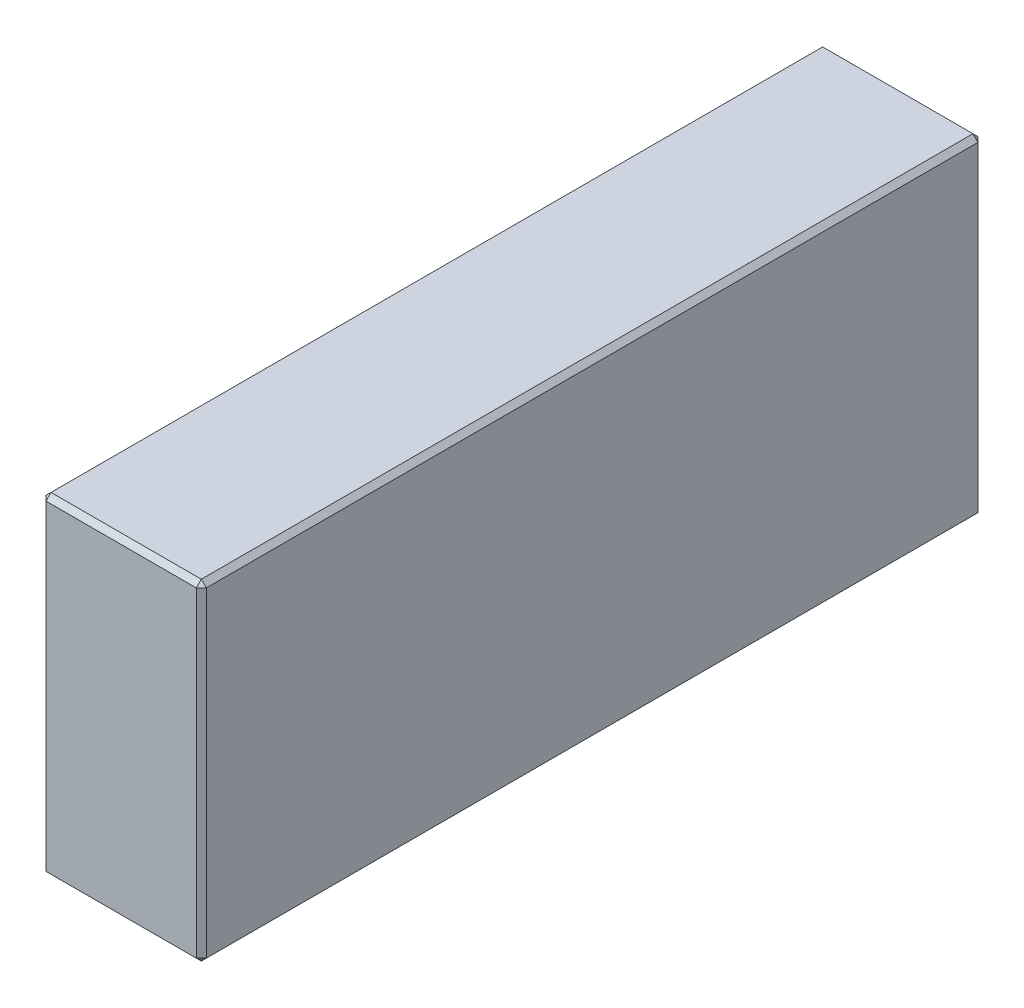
ISO-10303-21;
HEADER;
FILE_DESCRIPTION(('STEP AP214'),'2;1');
FILE_NAME('part.step','',(''),(''),'','','');
FILE_SCHEMA(('AUTOMOTIVE_DESIGN { 1 0 10303 214 1 1 1 1 }'));
ENDSEC;
DATA;
#1=APPLICATION_CONTEXT('core data for automotive mechanical design processes');
#2=APPLICATION_PROTOCOL_DEFINITION('international standard','automotive_design',2000,#1);
#3=PRODUCT_CONTEXT('',#1,'mechanical');
#4=PRODUCT('Part','Part','',(#3));
#5=PRODUCT_RELATED_PRODUCT_CATEGORY('part','',(#4));
#6=PRODUCT_DEFINITION_FORMATION('','',#4);
#7=PRODUCT_DEFINITION_CONTEXT('part definition',#1,'design');
#8=PRODUCT_DEFINITION('design','',#6,#7);
#9=PRODUCT_DEFINITION_SHAPE('','',#8);
#10=(LENGTH_UNIT() NAMED_UNIT(*) SI_UNIT(.MILLI.,.METRE.));
#11=(NAMED_UNIT(*) PLANE_ANGLE_UNIT() SI_UNIT($,.RADIAN.));
#12=(NAMED_UNIT(*) SI_UNIT($,.STERADIAN.) SOLID_ANGLE_UNIT());
#13=UNCERTAINTY_MEASURE_WITH_UNIT(LENGTH_MEASURE(1.E-05),#10,'distance_accuracy_value','');
#14=(GEOMETRIC_REPRESENTATION_CONTEXT(3) GLOBAL_UNCERTAINTY_ASSIGNED_CONTEXT((#13)) GLOBAL_UNIT_ASSIGNED_CONTEXT((#10,
#11,#12)) REPRESENTATION_CONTEXT('',''));
#15=CARTESIAN_POINT('',(0.,0.,0.));
#16=DIRECTION('',(0.,0.,1.));
#17=DIRECTION('',(1.,0.,0.));
#18=AXIS2_PLACEMENT_3D('',#15,#16,#17);
#19=CARTESIAN_POINT('',(-16.,66.,78.));
#20=DIRECTION('',(1.,0.,0.));
#21=DIRECTION('',(0.,0.,-1.));
#22=AXIS2_PLACEMENT_3D('',#19,#20,#21);
#23=PLANE('',#22);
#24=DIRECTION('',(0.,-1.,0.));
#25=VECTOR('',#24,1.);
#26=CARTESIAN_POINT('',(-16.,66.,-77.));
#27=LINE('',#26,#25);
#28=CARTESIAN_POINT('',(-16.,65.,-77.));
#29=VERTEX_POINT('',#28);
#30=CARTESIAN_POINT('',(-16.,1.00000000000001,-77.));
#31=VERTEX_POINT('',#30);
#32=EDGE_CURVE('E114',#29,#31,#27,.T.);
#33=ORIENTED_EDGE('',*,*,#32,.T.);
#34=DIRECTION('',(0.,0.,1.));
#35=VECTOR('',#34,1.);
#36=CARTESIAN_POINT('',(-16.,1.00000000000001,78.));
#37=LINE('',#36,#35);
#38=CARTESIAN_POINT('',(-16.,1.00000000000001,77.));
#39=VERTEX_POINT('',#38);
#40=EDGE_CURVE('E110',#31,#39,#37,.T.);
#41=ORIENTED_EDGE('',*,*,#40,.T.);
#42=DIRECTION('',(0.,1.,0.));
#43=VECTOR('',#42,1.);
#44=CARTESIAN_POINT('',(-16.,66.,77.));
#45=LINE('',#44,#43);
#46=CARTESIAN_POINT('',(-16.,65.,77.));
#47=VERTEX_POINT('',#46);
#48=EDGE_CURVE('E103',#39,#47,#45,.T.);
#49=ORIENTED_EDGE('',*,*,#48,.T.);
#50=DIRECTION('',(0.,0.,-1.));
#51=VECTOR('',#50,1.);
#52=CARTESIAN_POINT('',(-16.,65.,-78.));
#53=LINE('',#52,#51);
#54=EDGE_CURVE('E107',#47,#29,#53,.T.);
#55=ORIENTED_EDGE('',*,*,#54,.T.);
#56=EDGE_LOOP('',(#33,#41,#49,#55));
#57=FACE_BOUND('',#56,.T.);
#58=ADVANCED_FACE('F15',(#57),#23,.F.);
#59=CARTESIAN_POINT('',(16.,66.,78.));
#60=DIRECTION('',(0.,0.,-1.));
#61=DIRECTION('',(-1.,0.,0.));
#62=AXIS2_PLACEMENT_3D('',#59,#60,#61);
#63=PLANE('',#62);
#64=DIRECTION('',(-1.,0.,0.));
#65=VECTOR('',#64,1.);
#66=CARTESIAN_POINT('',(-16.,65.,78.));
#67=LINE('',#66,#65);
#68=CARTESIAN_POINT('',(15.,65.,78.));
#69=VERTEX_POINT('',#68);
#70=CARTESIAN_POINT('',(-15.,65.,78.));
#71=VERTEX_POINT('',#70);
#72=EDGE_CURVE('E164',#69,#71,#67,.T.);
#73=ORIENTED_EDGE('',*,*,#72,.T.);
#74=DIRECTION('',(0.,-1.,0.));
#75=VECTOR('',#74,1.);
#76=CARTESIAN_POINT('',(-15.,66.,78.));
#77=LINE('',#76,#75);
#78=CARTESIAN_POINT('',(-15.,1.00000000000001,78.));
#79=VERTEX_POINT('',#78);
#80=EDGE_CURVE('E122',#71,#79,#77,.T.);
#81=ORIENTED_EDGE('',*,*,#80,.T.);
#82=DIRECTION('',(1.,0.,0.));
#83=VECTOR('',#82,1.);
#84=CARTESIAN_POINT('',(16.,1.00000000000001,78.));
#85=LINE('',#84,#83);
#86=CARTESIAN_POINT('',(15.,1.00000000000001,78.));
#87=VERTEX_POINT('',#86);
#88=EDGE_CURVE('E168',#79,#87,#85,.T.);
#89=ORIENTED_EDGE('',*,*,#88,.T.);
#90=DIRECTION('',(0.,1.,0.));
#91=VECTOR('',#90,1.);
#92=CARTESIAN_POINT('',(15.,66.,78.));
#93=LINE('',#92,#91);
#94=EDGE_CURVE('E166',#87,#69,#93,.T.);
#95=ORIENTED_EDGE('',*,*,#94,.T.);
#96=EDGE_LOOP('',(#73,#81,#89,#95));
#97=FACE_BOUND('',#96,.T.);
#98=ADVANCED_FACE('F275',(#97),#63,.F.);
#99=CARTESIAN_POINT('',(16.,66.,78.));
#100=DIRECTION('',(-1.,0.,0.));
#101=DIRECTION('',(0.,0.,1.));
#102=AXIS2_PLACEMENT_3D('',#99,#100,#101);
#103=PLANE('',#102);
#104=DIRECTION('',(0.,0.,-1.));
#105=VECTOR('',#104,1.);
#106=CARTESIAN_POINT('',(16.,1.00000000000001,78.));
#107=LINE('',#106,#105);
#108=CARTESIAN_POINT('',(16.,1.00000000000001,77.));
#109=VERTEX_POINT('',#108);
#110=CARTESIAN_POINT('',(16.,1.00000000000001,-77.));
#111=VERTEX_POINT('',#110);
#112=EDGE_CURVE('E159',#109,#111,#107,.T.);
#113=ORIENTED_EDGE('',*,*,#112,.T.);
#114=DIRECTION('',(0.,1.,0.));
#115=VECTOR('',#114,1.);
#116=CARTESIAN_POINT('',(16.,66.,-77.));
#117=LINE('',#116,#115);
#118=CARTESIAN_POINT('',(16.,65.,-77.));
#119=VERTEX_POINT('',#118);
#120=EDGE_CURVE('E161',#111,#119,#117,.T.);
#121=ORIENTED_EDGE('',*,*,#120,.T.);
#122=DIRECTION('',(0.,0.,1.));
#123=VECTOR('',#122,1.);
#124=CARTESIAN_POINT('',(16.,65.,78.));
#125=LINE('',#124,#123);
#126=CARTESIAN_POINT('',(16.,65.,77.));
#127=VERTEX_POINT('',#126);
#128=EDGE_CURVE('E155',#119,#127,#125,.T.);
#129=ORIENTED_EDGE('',*,*,#128,.T.);
#130=DIRECTION('',(0.,-1.,0.));
#131=VECTOR('',#130,1.);
#132=CARTESIAN_POINT('',(16.,66.,77.));
#133=LINE('',#132,#131);
#134=EDGE_CURVE('E157',#127,#109,#133,.T.);
#135=ORIENTED_EDGE('',*,*,#134,.T.);
#136=EDGE_LOOP('',(#113,#121,#129,#135));
#137=FACE_BOUND('',#136,.T.);
#138=ADVANCED_FACE('F254',(#137),#103,.F.);
#139=CARTESIAN_POINT('',(16.,66.,-78.));
#140=DIRECTION('',(0.,0.,1.));
#141=DIRECTION('',(1.,0.,0.));
#142=AXIS2_PLACEMENT_3D('',#139,#140,#141);
#143=PLANE('',#142);
#144=DIRECTION('',(0.,-1.,0.));
#145=VECTOR('',#144,1.);
#146=CARTESIAN_POINT('',(15.,66.,-78.));
#147=LINE('',#146,#145);
#148=CARTESIAN_POINT('',(15.,65.,-78.));
#149=VERTEX_POINT('',#148);
#150=CARTESIAN_POINT('',(15.,1.00000000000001,-78.));
#151=VERTEX_POINT('',#150);
#152=EDGE_CURVE('E148',#149,#151,#147,.T.);
#153=ORIENTED_EDGE('',*,*,#152,.T.);
#154=DIRECTION('',(-1.,0.,0.));
#155=VECTOR('',#154,1.);
#156=CARTESIAN_POINT('',(16.,1.00000000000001,-78.));
#157=LINE('',#156,#155);
#158=CARTESIAN_POINT('',(-15.,1.00000000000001,-78.));
#159=VERTEX_POINT('',#158);
#160=EDGE_CURVE('E153',#151,#159,#157,.T.);
#161=ORIENTED_EDGE('',*,*,#160,.T.);
#162=DIRECTION('',(0.,1.,0.));
#163=VECTOR('',#162,1.);
#164=CARTESIAN_POINT('',(-15.,66.,-78.));
#165=LINE('',#164,#163);
#166=CARTESIAN_POINT('',(-15.,65.,-78.));
#167=VERTEX_POINT('',#166);
#168=EDGE_CURVE('E150',#159,#167,#165,.T.);
#169=ORIENTED_EDGE('',*,*,#168,.T.);
#170=DIRECTION('',(1.,0.,0.));
#171=VECTOR('',#170,1.);
#172=CARTESIAN_POINT('',(16.,65.,-78.));
#173=LINE('',#172,#171);
#174=EDGE_CURVE('E146',#167,#149,#173,.T.);
#175=ORIENTED_EDGE('',*,*,#174,.T.);
#176=EDGE_LOOP('',(#153,#161,#169,#175));
#177=FACE_BOUND('',#176,.T.);
#178=ADVANCED_FACE('F284',(#177),#143,.F.);
#179=CARTESIAN_POINT('',(0.,66.,0.));
#180=DIRECTION('',(0.,1.,0.));
#181=DIRECTION('',(0.,0.,1.));
#182=AXIS2_PLACEMENT_3D('',#179,#180,#181);
#183=PLANE('',#182);
#184=DIRECTION('',(0.,0.,-1.));
#185=VECTOR('',#184,1.);
#186=CARTESIAN_POINT('',(15.,66.,-78.));
#187=LINE('',#186,#185);
#188=CARTESIAN_POINT('',(15.,66.,77.));
#189=VERTEX_POINT('',#188);
#190=CARTESIAN_POINT('',(15.,66.,-77.));
#191=VERTEX_POINT('',#190);
#192=EDGE_CURVE('E24',#189,#191,#187,.T.);
#193=ORIENTED_EDGE('',*,*,#192,.T.);
#194=DIRECTION('',(-1.,0.,0.));
#195=VECTOR('',#194,1.);
#196=CARTESIAN_POINT('',(-16.,66.,-77.));
#197=LINE('',#196,#195);
#198=CARTESIAN_POINT('',(-15.,66.,-77.));
#199=VERTEX_POINT('',#198);
#200=EDGE_CURVE('E9',#191,#199,#197,.T.);
#201=ORIENTED_EDGE('',*,*,#200,.T.);
#202=DIRECTION('',(0.,0.,1.));
#203=VECTOR('',#202,1.);
#204=CARTESIAN_POINT('',(-15.,66.,78.));
#205=LINE('',#204,#203);
#206=CARTESIAN_POINT('',(-15.,66.,77.));
#207=VERTEX_POINT('',#206);
#208=EDGE_CURVE('E180',#199,#207,#205,.T.);
#209=ORIENTED_EDGE('',*,*,#208,.T.);
#210=DIRECTION('',(1.,0.,0.));
#211=VECTOR('',#210,1.);
#212=CARTESIAN_POINT('',(16.,66.,77.));
#213=LINE('',#212,#211);
#214=EDGE_CURVE('E35',#207,#189,#213,.T.);
#215=ORIENTED_EDGE('',*,*,#214,.T.);
#216=EDGE_LOOP('',(#193,#201,#209,#215));
#217=FACE_BOUND('',#216,.T.);
#218=ADVANCED_FACE('F350',(#217),#183,.T.);
#219=CARTESIAN_POINT('',(0.,0.,0.));
#220=DIRECTION('',(0.,1.,0.));
#221=DIRECTION('',(0.,0.,1.));
#222=AXIS2_PLACEMENT_3D('',#219,#220,#221);
#223=PLANE('',#222);
#224=DIRECTION('',(0.,0.,1.));
#225=VECTOR('',#224,1.);
#226=CARTESIAN_POINT('',(15.,0.,0.));
#227=LINE('',#226,#225);
#228=CARTESIAN_POINT('',(15.,0.,-77.));
#229=VERTEX_POINT('',#228);
#230=CARTESIAN_POINT('',(15.,0.,77.));
#231=VERTEX_POINT('',#230);
#232=EDGE_CURVE('E171',#229,#231,#227,.T.);
#233=ORIENTED_EDGE('',*,*,#232,.T.);
#234=DIRECTION('',(-1.,0.,0.));
#235=VECTOR('',#234,1.);
#236=CARTESIAN_POINT('',(0.,0.,77.));
#237=LINE('',#236,#235);
#238=CARTESIAN_POINT('',(-15.,0.,77.));
#239=VERTEX_POINT('',#238);
#240=EDGE_CURVE('E177',#231,#239,#237,.T.);
#241=ORIENTED_EDGE('',*,*,#240,.T.);
#242=DIRECTION('',(0.,0.,-1.));
#243=VECTOR('',#242,1.);
#244=CARTESIAN_POINT('',(-15.,0.,0.));
#245=LINE('',#244,#243);
#246=CARTESIAN_POINT('',(-15.,0.,-77.));
#247=VERTEX_POINT('',#246);
#248=EDGE_CURVE('E175',#239,#247,#245,.T.);
#249=ORIENTED_EDGE('',*,*,#248,.T.);
#250=DIRECTION('',(1.,0.,0.));
#251=VECTOR('',#250,1.);
#252=CARTESIAN_POINT('',(0.,0.,-77.));
#253=LINE('',#252,#251);
#254=EDGE_CURVE('E173',#247,#229,#253,.T.);
#255=ORIENTED_EDGE('',*,*,#254,.T.);
#256=EDGE_LOOP('',(#233,#241,#249,#255));
#257=FACE_BOUND('',#256,.T.);
#258=ADVANCED_FACE('F246',(#257),#223,.F.);
#259=CARTESIAN_POINT('',(16.,66.,77.));
#260=DIRECTION('',(-0.707106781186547,0.,-0.707106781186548));
#261=DIRECTION('',(0.,-1.,0.));
#262=AXIS2_PLACEMENT_3D('',#259,#260,#261);
#263=PLANE('',#262);
#264=DIRECTION('',(-0.707106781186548,0.,0.707106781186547));
#265=VECTOR('',#264,1.);
#266=CARTESIAN_POINT('',(15.,65.,78.));
#267=LINE('',#266,#265);
#268=EDGE_CURVE('E19',#69,#127,#267,.F.);
#269=ORIENTED_EDGE('',*,*,#268,.F.);
#270=ORIENTED_EDGE('',*,*,#94,.F.);
#271=DIRECTION('',(0.707106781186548,0.,-0.707106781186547));
#272=VECTOR('',#271,1.);
#273=CARTESIAN_POINT('',(15.,1.00000000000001,78.));
#274=LINE('',#273,#272);
#275=EDGE_CURVE('E142',#109,#87,#274,.F.);
#276=ORIENTED_EDGE('',*,*,#275,.F.);
#277=ORIENTED_EDGE('',*,*,#134,.F.);
#278=EDGE_LOOP('',(#269,#270,#276,#277));
#279=FACE_BOUND('',#278,.T.);
#280=ADVANCED_FACE('F17',(#279),#263,.F.);
#281=CARTESIAN_POINT('',(15.,65.,78.));
#282=DIRECTION('',(0.577350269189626,0.577350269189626,0.577350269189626));
#283=DIRECTION('',(0.707106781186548,0.,-0.707106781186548));
#284=AXIS2_PLACEMENT_3D('',#281,#282,#283);
#285=PLANE('',#284);
#286=DIRECTION('',(0.,-0.707106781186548,0.707106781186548));
#287=VECTOR('',#286,1.);
#288=CARTESIAN_POINT('',(15.,65.,78.));
#289=LINE('',#288,#287);
#290=EDGE_CURVE('E226',#69,#189,#289,.F.);
#291=ORIENTED_EDGE('',*,*,#290,.F.);
#292=ORIENTED_EDGE('',*,*,#268,.T.);
#293=DIRECTION('',(-0.707106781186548,0.707106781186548,0.));
#294=VECTOR('',#293,1.);
#295=CARTESIAN_POINT('',(15.5,65.5,77.));
#296=LINE('',#295,#294);
#297=EDGE_CURVE('E228',#189,#127,#296,.F.);
#298=ORIENTED_EDGE('',*,*,#297,.F.);
#299=EDGE_LOOP('',(#291,#292,#298));
#300=FACE_BOUND('',#299,.T.);
#301=ADVANCED_FACE('F270',(#300),#285,.T.);
#302=CARTESIAN_POINT('',(15.,1.00000000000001,78.));
#303=DIRECTION('',(0.577350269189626,-0.577350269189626,0.577350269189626));
#304=DIRECTION('',(0.707106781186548,0.,-0.707106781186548));
#305=AXIS2_PLACEMENT_3D('',#302,#303,#304);
#306=PLANE('',#305);
#307=DIRECTION('',(-0.707106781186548,-0.707106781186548,0.));
#308=VECTOR('',#307,1.);
#309=CARTESIAN_POINT('',(15.5,0.500000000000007,77.));
#310=LINE('',#309,#308);
#311=EDGE_CURVE('E220',#109,#231,#310,.T.);
#312=ORIENTED_EDGE('',*,*,#311,.F.);
#313=ORIENTED_EDGE('',*,*,#275,.T.);
#314=DIRECTION('',(0.,0.707106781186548,0.707106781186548));
#315=VECTOR('',#314,1.);
#316=CARTESIAN_POINT('',(15.,1.00000000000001,78.));
#317=LINE('',#316,#315);
#318=EDGE_CURVE('E223',#231,#87,#317,.T.);
#319=ORIENTED_EDGE('',*,*,#318,.F.);
#320=EDGE_LOOP('',(#312,#313,#319));
#321=FACE_BOUND('',#320,.T.);
#322=ADVANCED_FACE('F235',(#321),#306,.T.);
#323=CARTESIAN_POINT('',(15.,66.,0.));
#324=DIRECTION('',(0.707106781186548,0.707106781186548,0.));
#325=DIRECTION('',(0.,0.,1.));
#326=AXIS2_PLACEMENT_3D('',#323,#324,#325);
#327=PLANE('',#326);
#328=ORIENTED_EDGE('',*,*,#297,.T.);
#329=ORIENTED_EDGE('',*,*,#128,.F.);
#330=DIRECTION('',(0.707106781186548,-0.707106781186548,0.));
#331=VECTOR('',#330,1.);
#332=CARTESIAN_POINT('',(16.,65.,-77.));
#333=LINE('',#332,#331);
#334=EDGE_CURVE('E215',#191,#119,#333,.T.);
#335=ORIENTED_EDGE('',*,*,#334,.F.);
#336=ORIENTED_EDGE('',*,*,#192,.F.);
#337=EDGE_LOOP('',(#328,#329,#335,#336));
#338=FACE_BOUND('',#337,.T.);
#339=ADVANCED_FACE('F265',(#338),#327,.T.);
#340=CARTESIAN_POINT('',(0.,66.,77.));
#341=DIRECTION('',(0.,0.707106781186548,0.707106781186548));
#342=DIRECTION('',(-1.,0.,0.));
#343=AXIS2_PLACEMENT_3D('',#340,#341,#342);
#344=PLANE('',#343);
#345=ORIENTED_EDGE('',*,*,#290,.T.);
#346=ORIENTED_EDGE('',*,*,#214,.F.);
#347=DIRECTION('',(0.,0.707106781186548,-0.707106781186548));
#348=VECTOR('',#347,1.);
#349=CARTESIAN_POINT('',(-15.,65.5,77.5));
#350=LINE('',#349,#348);
#351=EDGE_CURVE('E126',#71,#207,#350,.T.);
#352=ORIENTED_EDGE('',*,*,#351,.F.);
#353=ORIENTED_EDGE('',*,*,#72,.F.);
#354=EDGE_LOOP('',(#345,#346,#352,#353));
#355=FACE_BOUND('',#354,.T.);
#356=ADVANCED_FACE('F273',(#355),#344,.T.);
#357=CARTESIAN_POINT('',(-15.,66.,78.));
#358=DIRECTION('',(0.707106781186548,0.,-0.707106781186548));
#359=DIRECTION('',(0.,-1.,0.));
#360=AXIS2_PLACEMENT_3D('',#357,#358,#359);
#361=PLANE('',#360);
#362=DIRECTION('',(0.707106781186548,0.,0.707106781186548));
#363=VECTOR('',#362,1.);
#364=CARTESIAN_POINT('',(-15.,1.00000000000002,78.));
#365=LINE('',#364,#363);
#366=EDGE_CURVE('E127',#79,#39,#365,.F.);
#367=ORIENTED_EDGE('',*,*,#366,.F.);
#368=ORIENTED_EDGE('',*,*,#80,.F.);
#369=DIRECTION('',(-0.707106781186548,0.,-0.707106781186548));
#370=VECTOR('',#369,1.);
#371=CARTESIAN_POINT('',(-16.,65.,77.));
#372=LINE('',#371,#370);
#373=EDGE_CURVE('E118',#47,#71,#372,.F.);
#374=ORIENTED_EDGE('',*,*,#373,.F.);
#375=ORIENTED_EDGE('',*,*,#48,.F.);
#376=EDGE_LOOP('',(#367,#368,#374,#375));
#377=FACE_BOUND('',#376,.T.);
#378=ADVANCED_FACE('F120',(#377),#361,.F.);
#379=CARTESIAN_POINT('',(16.,1.00000000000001,78.));
#380=DIRECTION('',(0.,0.707106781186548,-0.707106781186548));
#381=DIRECTION('',(1.,0.,0.));
#382=AXIS2_PLACEMENT_3D('',#379,#380,#381);
#383=PLANE('',#382);
#384=ORIENTED_EDGE('',*,*,#318,.T.);
#385=ORIENTED_EDGE('',*,*,#88,.F.);
#386=DIRECTION('',(0.,-0.707106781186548,-0.707106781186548));
#387=VECTOR('',#386,1.);
#388=CARTESIAN_POINT('',(-15.,1.00000000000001,78.));
#389=LINE('',#388,#387);
#390=EDGE_CURVE('E211',#239,#79,#389,.F.);
#391=ORIENTED_EDGE('',*,*,#390,.F.);
#392=ORIENTED_EDGE('',*,*,#240,.F.);
#393=EDGE_LOOP('',(#384,#385,#391,#392));
#394=FACE_BOUND('',#393,.T.);
#395=ADVANCED_FACE('F243',(#394),#383,.F.);
#396=CARTESIAN_POINT('',(16.,1.00000000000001,78.));
#397=DIRECTION('',(-0.707106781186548,0.707106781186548,0.));
#398=DIRECTION('',(0.,0.,-1.));
#399=AXIS2_PLACEMENT_3D('',#396,#397,#398);
#400=PLANE('',#399);
#401=ORIENTED_EDGE('',*,*,#311,.T.);
#402=ORIENTED_EDGE('',*,*,#232,.F.);
#403=DIRECTION('',(0.707106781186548,0.707106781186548,0.));
#404=VECTOR('',#403,1.);
#405=CARTESIAN_POINT('',(15.5,0.500000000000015,-77.));
#406=LINE('',#405,#404);
#407=EDGE_CURVE('E208',#111,#229,#406,.F.);
#408=ORIENTED_EDGE('',*,*,#407,.F.);
#409=ORIENTED_EDGE('',*,*,#112,.F.);
#410=EDGE_LOOP('',(#401,#402,#408,#409));
#411=FACE_BOUND('',#410,.T.);
#412=ADVANCED_FACE('F251',(#411),#400,.F.);
#413=CARTESIAN_POINT('',(15.,66.,-78.));
#414=DIRECTION('',(-0.707106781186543,0.,0.707106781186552));
#415=DIRECTION('',(0.,-1.,0.));
#416=AXIS2_PLACEMENT_3D('',#413,#414,#415);
#417=PLANE('',#416);
#418=DIRECTION('',(0.707106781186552,0.,0.707106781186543));
#419=VECTOR('',#418,1.);
#420=CARTESIAN_POINT('',(16.,65.,-77.));
#421=LINE('',#420,#419);
#422=EDGE_CURVE('E217',#119,#149,#421,.F.);
#423=ORIENTED_EDGE('',*,*,#422,.F.);
#424=ORIENTED_EDGE('',*,*,#120,.F.);
#425=DIRECTION('',(-0.707106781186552,0.,-0.707106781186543));
#426=VECTOR('',#425,1.);
#427=CARTESIAN_POINT('',(15.,1.00000000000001,-78.));
#428=LINE('',#427,#426);
#429=EDGE_CURVE('E205',#151,#111,#428,.F.);
#430=ORIENTED_EDGE('',*,*,#429,.F.);
#431=ORIENTED_EDGE('',*,*,#152,.F.);
#432=EDGE_LOOP('',(#423,#424,#430,#431));
#433=FACE_BOUND('',#432,.T.);
#434=ADVANCED_FACE('F258',(#433),#417,.F.);
#435=CARTESIAN_POINT('',(16.,65.,-77.));
#436=DIRECTION('',(0.577350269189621,0.577350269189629,-0.577350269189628));
#437=DIRECTION('',(0.,0.707106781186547,0.707106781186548));
#438=AXIS2_PLACEMENT_3D('',#435,#436,#437);
#439=PLANE('',#438);
#440=ORIENTED_EDGE('',*,*,#334,.T.);
#441=ORIENTED_EDGE('',*,*,#422,.T.);
#442=DIRECTION('',(0.,0.707106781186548,0.707106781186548));
#443=VECTOR('',#442,1.);
#444=CARTESIAN_POINT('',(15.,65.5,-77.5));
#445=LINE('',#444,#443);
#446=EDGE_CURVE('E134',#191,#149,#445,.F.);
#447=ORIENTED_EDGE('',*,*,#446,.F.);
#448=EDGE_LOOP('',(#440,#441,#447));
#449=FACE_BOUND('',#448,.T.);
#450=ADVANCED_FACE('F325',(#449),#439,.T.);
#451=CARTESIAN_POINT('',(-16.,65.,77.));
#452=DIRECTION('',(-0.577350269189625,0.577350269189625,0.577350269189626));
#453=DIRECTION('',(0.707106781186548,0.,0.707106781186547));
#454=AXIS2_PLACEMENT_3D('',#451,#452,#453);
#455=PLANE('',#454);
#456=ORIENTED_EDGE('',*,*,#373,.T.);
#457=ORIENTED_EDGE('',*,*,#351,.T.);
#458=DIRECTION('',(-0.707106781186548,-0.707106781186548,0.));
#459=VECTOR('',#458,1.);
#460=CARTESIAN_POINT('',(-16.,65.,77.));
#461=LINE('',#460,#459);
#462=EDGE_CURVE('E130',#47,#207,#461,.F.);
#463=ORIENTED_EDGE('',*,*,#462,.F.);
#464=EDGE_LOOP('',(#456,#457,#463));
#465=FACE_BOUND('',#464,.T.);
#466=ADVANCED_FACE('F131',(#465),#455,.T.);
#467=CARTESIAN_POINT('',(-15.,1.00000000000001,78.));
#468=DIRECTION('',(-0.577350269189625,-0.577350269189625,0.577350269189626));
#469=DIRECTION('',(0.707106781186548,0.,0.707106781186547));
#470=AXIS2_PLACEMENT_3D('',#467,#468,#469);
#471=PLANE('',#470);
#472=ORIENTED_EDGE('',*,*,#390,.T.);
#473=ORIENTED_EDGE('',*,*,#366,.T.);
#474=DIRECTION('',(-0.707106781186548,0.707106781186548,0.));
#475=VECTOR('',#474,1.);
#476=CARTESIAN_POINT('',(-15.5,0.500000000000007,77.));
#477=LINE('',#476,#475);
#478=EDGE_CURVE('E135',#239,#39,#477,.T.);
#479=ORIENTED_EDGE('',*,*,#478,.F.);
#480=EDGE_LOOP('',(#472,#473,#479));
#481=FACE_BOUND('',#480,.T.);
#482=ADVANCED_FACE('F318',(#481),#471,.T.);
#483=CARTESIAN_POINT('',(15.,1.00000000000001,-78.));
#484=DIRECTION('',(0.577350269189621,-0.577350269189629,-0.577350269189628));
#485=DIRECTION('',(0.,0.707106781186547,-0.707106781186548));
#486=AXIS2_PLACEMENT_3D('',#483,#484,#485);
#487=PLANE('',#486);
#488=ORIENTED_EDGE('',*,*,#429,.T.);
#489=ORIENTED_EDGE('',*,*,#407,.T.);
#490=DIRECTION('',(0.,-0.707106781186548,0.707106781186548));
#491=VECTOR('',#490,1.);
#492=CARTESIAN_POINT('',(15.,1.00000000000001,-78.));
#493=LINE('',#492,#491);
#494=EDGE_CURVE('E198',#151,#229,#493,.T.);
#495=ORIENTED_EDGE('',*,*,#494,.F.);
#496=EDGE_LOOP('',(#488,#489,#495));
#497=FACE_BOUND('',#496,.T.);
#498=ADVANCED_FACE('F314',(#497),#487,.T.);
#499=CARTESIAN_POINT('',(0.,66.,-77.));
#500=DIRECTION('',(0.,0.707106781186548,-0.707106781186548));
#501=DIRECTION('',(1.,0.,0.));
#502=AXIS2_PLACEMENT_3D('',#499,#500,#501);
#503=PLANE('',#502);
#504=ORIENTED_EDGE('',*,*,#446,.T.);
#505=ORIENTED_EDGE('',*,*,#174,.F.);
#506=DIRECTION('',(0.,-0.707106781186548,-0.707106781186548));
#507=VECTOR('',#506,1.);
#508=CARTESIAN_POINT('',(-15.,65.,-78.));
#509=LINE('',#508,#507);
#510=EDGE_CURVE('E195',#199,#167,#509,.T.);
#511=ORIENTED_EDGE('',*,*,#510,.F.);
#512=ORIENTED_EDGE('',*,*,#200,.F.);
#513=EDGE_LOOP('',(#504,#505,#511,#512));
#514=FACE_BOUND('',#513,.T.);
#515=ADVANCED_FACE('F311',(#514),#503,.T.);
#516=CARTESIAN_POINT('',(-15.,66.,0.));
#517=DIRECTION('',(-0.707106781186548,0.707106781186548,0.));
#518=DIRECTION('',(0.,0.,-1.));
#519=AXIS2_PLACEMENT_3D('',#516,#517,#518);
#520=PLANE('',#519);
#521=ORIENTED_EDGE('',*,*,#462,.T.);
#522=ORIENTED_EDGE('',*,*,#208,.F.);
#523=DIRECTION('',(0.707106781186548,0.707106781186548,0.));
#524=VECTOR('',#523,1.);
#525=CARTESIAN_POINT('',(-15.5,65.5,-77.));
#526=LINE('',#525,#524);
#527=EDGE_CURVE('E138',#29,#199,#526,.T.);
#528=ORIENTED_EDGE('',*,*,#527,.F.);
#529=ORIENTED_EDGE('',*,*,#54,.F.);
#530=EDGE_LOOP('',(#521,#522,#528,#529));
#531=FACE_BOUND('',#530,.T.);
#532=ADVANCED_FACE('F137',(#531),#520,.T.);
#533=CARTESIAN_POINT('',(-16.,1.00000000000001,78.));
#534=DIRECTION('',(0.707106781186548,0.707106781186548,0.));
#535=DIRECTION('',(0.,0.,1.));
#536=AXIS2_PLACEMENT_3D('',#533,#534,#535);
#537=PLANE('',#536);
#538=ORIENTED_EDGE('',*,*,#478,.T.);
#539=ORIENTED_EDGE('',*,*,#40,.F.);
#540=DIRECTION('',(0.707106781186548,-0.707106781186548,0.));
#541=VECTOR('',#540,1.);
#542=CARTESIAN_POINT('',(-16.,1.00000000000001,-77.));
#543=LINE('',#542,#541);
#544=EDGE_CURVE('E191',#247,#31,#543,.F.);
#545=ORIENTED_EDGE('',*,*,#544,.F.);
#546=ORIENTED_EDGE('',*,*,#248,.F.);
#547=EDGE_LOOP('',(#538,#539,#545,#546));
#548=FACE_BOUND('',#547,.T.);
#549=ADVANCED_FACE('F304',(#548),#537,.F.);
#550=CARTESIAN_POINT('',(16.,1.00000000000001,-78.));
#551=DIRECTION('',(0.,0.707106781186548,0.707106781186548));
#552=DIRECTION('',(-1.,0.,0.));
#553=AXIS2_PLACEMENT_3D('',#550,#551,#552);
#554=PLANE('',#553);
#555=ORIENTED_EDGE('',*,*,#494,.T.);
#556=ORIENTED_EDGE('',*,*,#254,.F.);
#557=DIRECTION('',(0.,0.707106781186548,-0.707106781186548));
#558=VECTOR('',#557,1.);
#559=CARTESIAN_POINT('',(-15.,0.5,-77.5));
#560=LINE('',#559,#558);
#561=EDGE_CURVE('E188',#159,#247,#560,.F.);
#562=ORIENTED_EDGE('',*,*,#561,.F.);
#563=ORIENTED_EDGE('',*,*,#160,.F.);
#564=EDGE_LOOP('',(#555,#556,#562,#563));
#565=FACE_BOUND('',#564,.T.);
#566=ADVANCED_FACE('F300',(#565),#554,.F.);
#567=CARTESIAN_POINT('',(-15.,65.,-78.));
#568=DIRECTION('',(-0.577350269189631,0.577350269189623,-0.577350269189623));
#569=DIRECTION('',(-0.707106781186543,0.,0.707106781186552));
#570=AXIS2_PLACEMENT_3D('',#567,#568,#569);
#571=PLANE('',#570);
#572=ORIENTED_EDGE('',*,*,#527,.T.);
#573=ORIENTED_EDGE('',*,*,#510,.T.);
#574=DIRECTION('',(0.707106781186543,0.,-0.707106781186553));
#575=VECTOR('',#574,1.);
#576=CARTESIAN_POINT('',(-15.,65.,-78.));
#577=LINE('',#576,#575);
#578=EDGE_CURVE('E186',#29,#167,#577,.T.);
#579=ORIENTED_EDGE('',*,*,#578,.F.);
#580=EDGE_LOOP('',(#572,#573,#579));
#581=FACE_BOUND('',#580,.T.);
#582=ADVANCED_FACE('F296',(#581),#571,.T.);
#583=CARTESIAN_POINT('',(-16.,1.00000000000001,-77.));
#584=DIRECTION('',(-0.577350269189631,-0.577350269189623,-0.577350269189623));
#585=DIRECTION('',(-0.707106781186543,0.,0.707106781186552));
#586=AXIS2_PLACEMENT_3D('',#583,#584,#585);
#587=PLANE('',#586);
#588=ORIENTED_EDGE('',*,*,#561,.T.);
#589=ORIENTED_EDGE('',*,*,#544,.T.);
#590=DIRECTION('',(-0.707106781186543,0.,0.707106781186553));
#591=VECTOR('',#590,1.);
#592=CARTESIAN_POINT('',(-16.,1.00000000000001,-77.));
#593=LINE('',#592,#591);
#594=EDGE_CURVE('E184',#159,#31,#593,.T.);
#595=ORIENTED_EDGE('',*,*,#594,.F.);
#596=EDGE_LOOP('',(#588,#589,#595));
#597=FACE_BOUND('',#596,.T.);
#598=ADVANCED_FACE('F292',(#597),#587,.T.);
#599=CARTESIAN_POINT('',(-16.,66.,-77.));
#600=DIRECTION('',(0.707106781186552,0.,0.707106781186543));
#601=DIRECTION('',(0.,-1.,0.));
#602=AXIS2_PLACEMENT_3D('',#599,#600,#601);
#603=PLANE('',#602);
#604=ORIENTED_EDGE('',*,*,#578,.T.);
#605=ORIENTED_EDGE('',*,*,#168,.F.);
#606=ORIENTED_EDGE('',*,*,#594,.T.);
#607=ORIENTED_EDGE('',*,*,#32,.F.);
#608=EDGE_LOOP('',(#604,#605,#606,#607));
#609=FACE_BOUND('',#608,.T.);
#610=ADVANCED_FACE('F289',(#609),#603,.F.);
#611=CLOSED_SHELL('',(#58,#98,#138,#178,#218,#258,#280,#301,#322,#339,#356,#378,#395,#412,#434,
#450,#466,#482,#498,#515,#532,#549,#566,#582,#598,#610));
#612=MANIFOLD_SOLID_BREP('B1',#611);
#613=ADVANCED_BREP_SHAPE_REPRESENTATION('',(#18,#612),#14);
#614=SHAPE_DEFINITION_REPRESENTATION(#9,#613);
ENDSEC;
END-ISO-10303-21;
